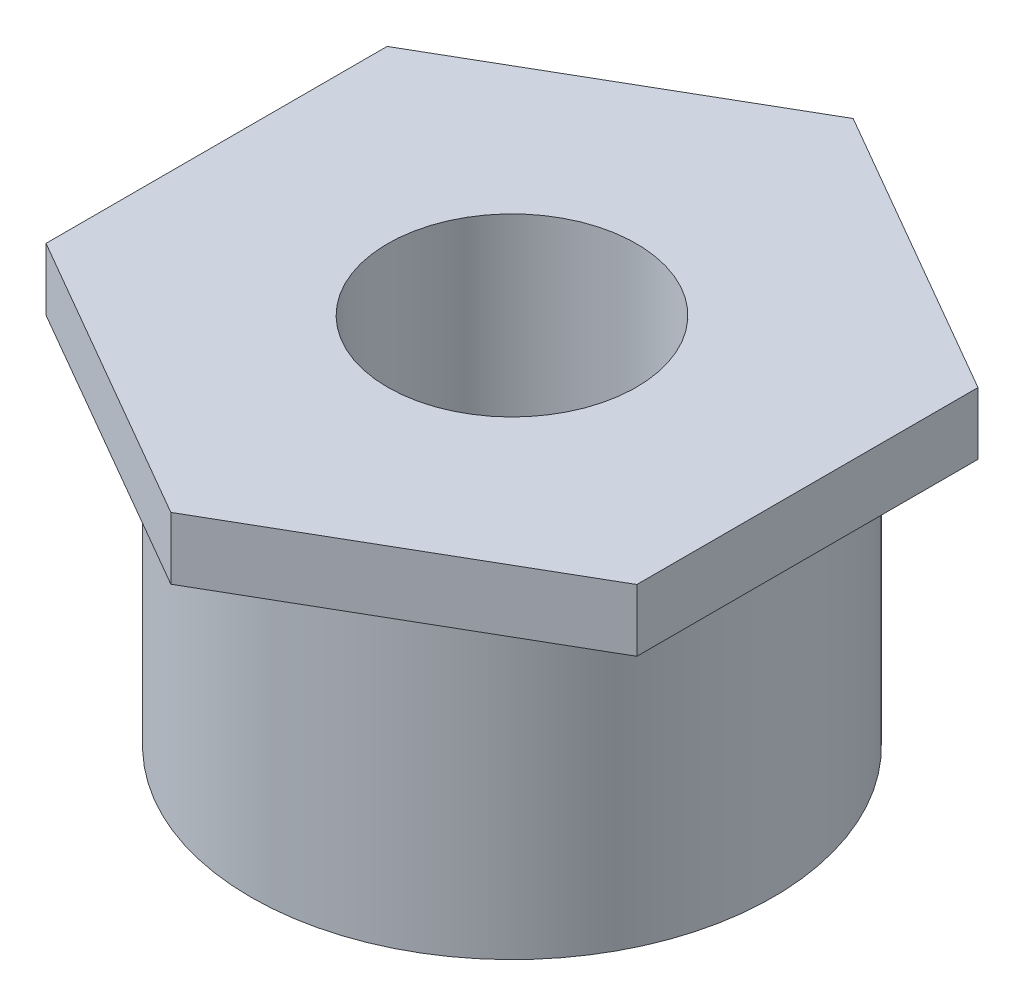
ISO-10303-21;
HEADER;
FILE_DESCRIPTION(('STEP AP214'),'2;1');
FILE_NAME('part.step','',(''),(''),'','','');
FILE_SCHEMA(('AUTOMOTIVE_DESIGN { 1 0 10303 214 1 1 1 1 }'));
ENDSEC;
DATA;
#1=APPLICATION_CONTEXT('core data for automotive mechanical design processes');
#2=APPLICATION_PROTOCOL_DEFINITION('international standard','automotive_design',2000,#1);
#3=PRODUCT_CONTEXT('',#1,'mechanical');
#4=PRODUCT('Part','Part','',(#3));
#5=PRODUCT_RELATED_PRODUCT_CATEGORY('part','',(#4));
#6=PRODUCT_DEFINITION_FORMATION('','',#4);
#7=PRODUCT_DEFINITION_CONTEXT('part definition',#1,'design');
#8=PRODUCT_DEFINITION('design','',#6,#7);
#9=PRODUCT_DEFINITION_SHAPE('','',#8);
#10=(LENGTH_UNIT() NAMED_UNIT(*) SI_UNIT(.MILLI.,.METRE.));
#11=(NAMED_UNIT(*) PLANE_ANGLE_UNIT() SI_UNIT($,.RADIAN.));
#12=(NAMED_UNIT(*) SI_UNIT($,.STERADIAN.) SOLID_ANGLE_UNIT());
#13=UNCERTAINTY_MEASURE_WITH_UNIT(LENGTH_MEASURE(1.E-05),#10,'distance_accuracy_value','');
#14=(GEOMETRIC_REPRESENTATION_CONTEXT(3) GLOBAL_UNCERTAINTY_ASSIGNED_CONTEXT((#13)) GLOBAL_UNIT_ASSIGNED_CONTEXT((#10,
#11,#12)) REPRESENTATION_CONTEXT('',''));
#15=CARTESIAN_POINT('',(0.,0.,0.));
#16=DIRECTION('',(0.,0.,1.));
#17=DIRECTION('',(1.,0.,0.));
#18=AXIS2_PLACEMENT_3D('',#15,#16,#17);
#19=CARTESIAN_POINT('',(0.,-3.,0.));
#20=DIRECTION('',(0.,1.,0.));
#21=DIRECTION('',(0.,0.,1.));
#22=AXIS2_PLACEMENT_3D('',#19,#20,#21);
#23=CYLINDRICAL_SURFACE('',#22,2.1);
#24=CARTESIAN_POINT('',(0.,-3.,0.));
#25=DIRECTION('',(0.,1.,0.));
#26=DIRECTION('',(0.,0.,1.));
#27=AXIS2_PLACEMENT_3D('',#24,#25,#26);
#28=CIRCLE('',#27,2.1);
#29=CARTESIAN_POINT('',(0.,-3.,2.1));
#30=VERTEX_POINT('',#29);
#31=EDGE_CURVE('E11',#30,#30,#28,.T.);
#32=ORIENTED_EDGE('',*,*,#31,.T.);
#33=EDGE_LOOP('',(#32));
#34=FACE_BOUND('',#33,.T.);
#35=CARTESIAN_POINT('',(0.,-0.5,0.));
#36=DIRECTION('',(0.,1.,0.));
#37=DIRECTION('',(0.,0.,1.));
#38=AXIS2_PLACEMENT_3D('',#35,#36,#37);
#39=CIRCLE('',#38,2.1);
#40=CARTESIAN_POINT('',(0.,-0.5,2.1));
#41=VERTEX_POINT('',#40);
#42=EDGE_CURVE('E147',#41,#41,#39,.T.);
#43=ORIENTED_EDGE('',*,*,#42,.F.);
#44=EDGE_LOOP('',(#43));
#45=FACE_BOUND('',#44,.T.);
#46=ADVANCED_FACE('F43',(#34,#45),#23,.T.);
#47=CARTESIAN_POINT('',(0.,-3.,0.));
#48=DIRECTION('',(0.,1.,0.));
#49=DIRECTION('',(0.,0.,1.));
#50=AXIS2_PLACEMENT_3D('',#47,#48,#49);
#51=CYLINDRICAL_SURFACE('',#50,1.);
#52=CARTESIAN_POINT('',(0.,-3.,0.));
#53=DIRECTION('',(0.,1.,0.));
#54=DIRECTION('',(0.,0.,1.));
#55=AXIS2_PLACEMENT_3D('',#52,#53,#54);
#56=CIRCLE('',#55,1.);
#57=CARTESIAN_POINT('',(0.,-3.,1.));
#58=VERTEX_POINT('',#57);
#59=EDGE_CURVE('E53',#58,#58,#56,.T.);
#60=ORIENTED_EDGE('',*,*,#59,.F.);
#61=EDGE_LOOP('',(#60));
#62=FACE_BOUND('',#61,.T.);
#63=CARTESIAN_POINT('',(0.,0.,0.));
#64=DIRECTION('',(0.,1.,0.));
#65=DIRECTION('',(0.,0.,1.));
#66=AXIS2_PLACEMENT_3D('',#63,#64,#65);
#67=CIRCLE('',#66,1.);
#68=CARTESIAN_POINT('',(0.,0.,1.));
#69=VERTEX_POINT('',#68);
#70=EDGE_CURVE('E47',#69,#69,#67,.T.);
#71=ORIENTED_EDGE('',*,*,#70,.T.);
#72=EDGE_LOOP('',(#71));
#73=FACE_BOUND('',#72,.T.);
#74=ADVANCED_FACE('F45',(#62,#73),#51,.F.);
#75=CARTESIAN_POINT('',(0.,-3.,0.));
#76=DIRECTION('',(0.,1.,0.));
#77=DIRECTION('',(0.,0.,1.));
#78=AXIS2_PLACEMENT_3D('',#75,#76,#77);
#79=PLANE('',#78);
#80=ORIENTED_EDGE('',*,*,#59,.T.);
#81=EDGE_LOOP('',(#80));
#82=FACE_BOUND('',#81,.T.);
#83=ORIENTED_EDGE('',*,*,#31,.F.);
#84=EDGE_LOOP('',(#83));
#85=FACE_BOUND('',#84,.T.);
#86=ADVANCED_FACE('F165',(#82,#85),#79,.F.);
#87=CARTESIAN_POINT('',(0.,0.,0.));
#88=DIRECTION('',(0.,1.,0.));
#89=DIRECTION('',(0.,0.,1.));
#90=AXIS2_PLACEMENT_3D('',#87,#88,#89);
#91=PLANE('',#90);
#92=ORIENTED_EDGE('',*,*,#70,.F.);
#93=EDGE_LOOP('',(#92));
#94=FACE_BOUND('',#93,.T.);
#95=DIRECTION('',(0.,0.,-1.));
#96=VECTOR('',#95,1.);
#97=CARTESIAN_POINT('',(2.375,0.,0.));
#98=LINE('',#97,#96);
#99=CARTESIAN_POINT('',(2.375,0.,1.37120688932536));
#100=VERTEX_POINT('',#99);
#101=CARTESIAN_POINT('',(2.375,0.,-1.37120688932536));
#102=VERTEX_POINT('',#101);
#103=EDGE_CURVE('E132',#100,#102,#98,.T.);
#104=ORIENTED_EDGE('',*,*,#103,.T.);
#105=DIRECTION('',(-0.866025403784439,0.,-0.5));
#106=VECTOR('',#105,1.);
#107=CARTESIAN_POINT('',(1.1875,0.,-2.05681033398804));
#108=LINE('',#107,#106);
#109=CARTESIAN_POINT('',(0.,0.,-2.74241377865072));
#110=VERTEX_POINT('',#109);
#111=EDGE_CURVE('E135',#102,#110,#108,.T.);
#112=ORIENTED_EDGE('',*,*,#111,.T.);
#113=DIRECTION('',(-0.866025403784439,0.,0.5));
#114=VECTOR('',#113,1.);
#115=CARTESIAN_POINT('',(-1.1875,0.,-2.05681033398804));
#116=LINE('',#115,#114);
#117=CARTESIAN_POINT('',(-2.375,0.,-1.37120688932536));
#118=VERTEX_POINT('',#117);
#119=EDGE_CURVE('E138',#110,#118,#116,.T.);
#120=ORIENTED_EDGE('',*,*,#119,.T.);
#121=DIRECTION('',(0.,0.,1.));
#122=VECTOR('',#121,1.);
#123=CARTESIAN_POINT('',(-2.375,0.,0.));
#124=LINE('',#123,#122);
#125=CARTESIAN_POINT('',(-2.375,0.,1.37120688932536));
#126=VERTEX_POINT('',#125);
#127=EDGE_CURVE('E141',#118,#126,#124,.T.);
#128=ORIENTED_EDGE('',*,*,#127,.T.);
#129=DIRECTION('',(0.866025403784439,0.,0.5));
#130=VECTOR('',#129,1.);
#131=CARTESIAN_POINT('',(-1.1875,0.,2.05681033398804));
#132=LINE('',#131,#130);
#133=CARTESIAN_POINT('',(0.,0.,2.74241377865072));
#134=VERTEX_POINT('',#133);
#135=EDGE_CURVE('E109',#126,#134,#132,.T.);
#136=ORIENTED_EDGE('',*,*,#135,.T.);
#137=DIRECTION('',(0.866025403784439,0.,-0.5));
#138=VECTOR('',#137,1.);
#139=CARTESIAN_POINT('',(1.1875,0.,2.05681033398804));
#140=LINE('',#139,#138);
#141=EDGE_CURVE('E144',#134,#100,#140,.T.);
#142=ORIENTED_EDGE('',*,*,#141,.T.);
#143=EDGE_LOOP('',(#104,#112,#120,#128,#136,#142));
#144=FACE_BOUND('',#143,.T.);
#145=ADVANCED_FACE('F161',(#94,#144),#91,.T.);
#146=CARTESIAN_POINT('',(2.375,-0.5,0.));
#147=DIRECTION('',(1.,0.,0.));
#148=DIRECTION('',(0.,0.,-1.));
#149=AXIS2_PLACEMENT_3D('',#146,#147,#148);
#150=PLANE('',#149);
#151=ORIENTED_EDGE('',*,*,#103,.F.);
#152=DIRECTION('',(0.,1.,0.));
#153=VECTOR('',#152,1.);
#154=CARTESIAN_POINT('',(2.375,-0.5,1.37120688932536));
#155=LINE('',#154,#153);
#156=CARTESIAN_POINT('',(2.375,-0.5,1.37120688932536));
#157=VERTEX_POINT('',#156);
#158=EDGE_CURVE('E61',#157,#100,#155,.T.);
#159=ORIENTED_EDGE('',*,*,#158,.F.);
#160=DIRECTION('',(0.,0.,-1.));
#161=VECTOR('',#160,1.);
#162=CARTESIAN_POINT('',(2.375,-0.5,0.));
#163=LINE('',#162,#161);
#164=CARTESIAN_POINT('',(2.375,-0.5,-1.37120688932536));
#165=VERTEX_POINT('',#164);
#166=EDGE_CURVE('E167',#157,#165,#163,.T.);
#167=ORIENTED_EDGE('',*,*,#166,.T.);
#168=DIRECTION('',(0.,1.,0.));
#169=VECTOR('',#168,1.);
#170=CARTESIAN_POINT('',(2.375,-0.5,-1.37120688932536));
#171=LINE('',#170,#169);
#172=EDGE_CURVE('E96',#165,#102,#171,.T.);
#173=ORIENTED_EDGE('',*,*,#172,.T.);
#174=EDGE_LOOP('',(#151,#159,#167,#173));
#175=FACE_BOUND('',#174,.T.);
#176=ADVANCED_FACE('F164',(#175),#150,.T.);
#177=CARTESIAN_POINT('',(1.1875,-0.5,2.05681033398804));
#178=DIRECTION('',(0.5,0.,0.866025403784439));
#179=DIRECTION('',(0.866025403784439,0.,-0.5));
#180=AXIS2_PLACEMENT_3D('',#177,#178,#179);
#181=PLANE('',#180);
#182=ORIENTED_EDGE('',*,*,#141,.F.);
#183=DIRECTION('',(0.,1.,0.));
#184=VECTOR('',#183,1.);
#185=CARTESIAN_POINT('',(0.,-0.5,2.74241377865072));
#186=LINE('',#185,#184);
#187=CARTESIAN_POINT('',(0.,-0.5,2.74241377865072));
#188=VERTEX_POINT('',#187);
#189=EDGE_CURVE('E84',#188,#134,#186,.T.);
#190=ORIENTED_EDGE('',*,*,#189,.F.);
#191=DIRECTION('',(0.866025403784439,0.,-0.5));
#192=VECTOR('',#191,1.);
#193=CARTESIAN_POINT('',(1.1875,-0.5,2.05681033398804));
#194=LINE('',#193,#192);
#195=EDGE_CURVE('E122',#188,#157,#194,.T.);
#196=ORIENTED_EDGE('',*,*,#195,.T.);
#197=ORIENTED_EDGE('',*,*,#158,.T.);
#198=EDGE_LOOP('',(#182,#190,#196,#197));
#199=FACE_BOUND('',#198,.T.);
#200=ADVANCED_FACE('F172',(#199),#181,.T.);
#201=CARTESIAN_POINT('',(-1.1875,-0.5,2.05681033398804));
#202=DIRECTION('',(-0.5,0.,0.866025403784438));
#203=DIRECTION('',(0.866025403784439,0.,0.5));
#204=AXIS2_PLACEMENT_3D('',#201,#202,#203);
#205=PLANE('',#204);
#206=ORIENTED_EDGE('',*,*,#135,.F.);
#207=DIRECTION('',(0.,1.,0.));
#208=VECTOR('',#207,1.);
#209=CARTESIAN_POINT('',(-2.375,-0.5,1.37120688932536));
#210=LINE('',#209,#208);
#211=CARTESIAN_POINT('',(-2.375,-0.5,1.37120688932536));
#212=VERTEX_POINT('',#211);
#213=EDGE_CURVE('E104',#212,#126,#210,.T.);
#214=ORIENTED_EDGE('',*,*,#213,.F.);
#215=DIRECTION('',(0.866025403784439,0.,0.5));
#216=VECTOR('',#215,1.);
#217=CARTESIAN_POINT('',(-1.1875,-0.5,2.05681033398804));
#218=LINE('',#217,#216);
#219=EDGE_CURVE('E107',#212,#188,#218,.T.);
#220=ORIENTED_EDGE('',*,*,#219,.T.);
#221=ORIENTED_EDGE('',*,*,#189,.T.);
#222=EDGE_LOOP('',(#206,#214,#220,#221));
#223=FACE_BOUND('',#222,.T.);
#224=ADVANCED_FACE('F106',(#223),#205,.T.);
#225=CARTESIAN_POINT('',(-2.375,-0.5,0.));
#226=DIRECTION('',(-1.,0.,0.));
#227=DIRECTION('',(0.,0.,1.));
#228=AXIS2_PLACEMENT_3D('',#225,#226,#227);
#229=PLANE('',#228);
#230=ORIENTED_EDGE('',*,*,#127,.F.);
#231=DIRECTION('',(0.,1.,0.));
#232=VECTOR('',#231,1.);
#233=CARTESIAN_POINT('',(-2.375,-0.5,-1.37120688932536));
#234=LINE('',#233,#232);
#235=CARTESIAN_POINT('',(-2.375,-0.5,-1.37120688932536));
#236=VERTEX_POINT('',#235);
#237=EDGE_CURVE('E114',#236,#118,#234,.T.);
#238=ORIENTED_EDGE('',*,*,#237,.F.);
#239=DIRECTION('',(0.,0.,1.));
#240=VECTOR('',#239,1.);
#241=CARTESIAN_POINT('',(-2.375,-0.5,0.));
#242=LINE('',#241,#240);
#243=EDGE_CURVE('E120',#236,#212,#242,.T.);
#244=ORIENTED_EDGE('',*,*,#243,.T.);
#245=ORIENTED_EDGE('',*,*,#213,.T.);
#246=EDGE_LOOP('',(#230,#238,#244,#245));
#247=FACE_BOUND('',#246,.T.);
#248=ADVANCED_FACE('F124',(#247),#229,.T.);
#249=CARTESIAN_POINT('',(-1.1875,-0.5,-2.05681033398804));
#250=DIRECTION('',(-0.5,0.,-0.866025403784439));
#251=DIRECTION('',(-0.866025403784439,0.,0.5));
#252=AXIS2_PLACEMENT_3D('',#249,#250,#251);
#253=PLANE('',#252);
#254=ORIENTED_EDGE('',*,*,#119,.F.);
#255=DIRECTION('',(0.,1.,0.));
#256=VECTOR('',#255,1.);
#257=CARTESIAN_POINT('',(0.,-0.5,-2.74241377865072));
#258=LINE('',#257,#256);
#259=CARTESIAN_POINT('',(0.,-0.5,-2.74241377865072));
#260=VERTEX_POINT('',#259);
#261=EDGE_CURVE('E151',#260,#110,#258,.T.);
#262=ORIENTED_EDGE('',*,*,#261,.F.);
#263=DIRECTION('',(-0.866025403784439,0.,0.5));
#264=VECTOR('',#263,1.);
#265=CARTESIAN_POINT('',(-1.1875,-0.5,-2.05681033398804));
#266=LINE('',#265,#264);
#267=EDGE_CURVE('E125',#260,#236,#266,.T.);
#268=ORIENTED_EDGE('',*,*,#267,.T.);
#269=ORIENTED_EDGE('',*,*,#237,.T.);
#270=EDGE_LOOP('',(#254,#262,#268,#269));
#271=FACE_BOUND('',#270,.T.);
#272=ADVANCED_FACE('F171',(#271),#253,.T.);
#273=CARTESIAN_POINT('',(1.1875,-0.5,-2.05681033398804));
#274=DIRECTION('',(0.5,0.,-0.866025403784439));
#275=DIRECTION('',(-0.866025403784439,0.,-0.5));
#276=AXIS2_PLACEMENT_3D('',#273,#274,#275);
#277=PLANE('',#276);
#278=ORIENTED_EDGE('',*,*,#111,.F.);
#279=ORIENTED_EDGE('',*,*,#172,.F.);
#280=DIRECTION('',(-0.866025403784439,0.,-0.5));
#281=VECTOR('',#280,1.);
#282=CARTESIAN_POINT('',(1.1875,-0.5,-2.05681033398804));
#283=LINE('',#282,#281);
#284=EDGE_CURVE('E127',#165,#260,#283,.T.);
#285=ORIENTED_EDGE('',*,*,#284,.T.);
#286=ORIENTED_EDGE('',*,*,#261,.T.);
#287=EDGE_LOOP('',(#278,#279,#285,#286));
#288=FACE_BOUND('',#287,.T.);
#289=ADVANCED_FACE('F168',(#288),#277,.T.);
#290=CARTESIAN_POINT('',(0.,-0.5,0.));
#291=DIRECTION('',(0.,1.,0.));
#292=DIRECTION('',(0.,0.,1.));
#293=AXIS2_PLACEMENT_3D('',#290,#291,#292);
#294=PLANE('',#293);
#295=ORIENTED_EDGE('',*,*,#42,.T.);
#296=EDGE_LOOP('',(#295));
#297=FACE_BOUND('',#296,.T.);
#298=ORIENTED_EDGE('',*,*,#166,.F.);
#299=ORIENTED_EDGE('',*,*,#195,.F.);
#300=ORIENTED_EDGE('',*,*,#219,.F.);
#301=ORIENTED_EDGE('',*,*,#243,.F.);
#302=ORIENTED_EDGE('',*,*,#267,.F.);
#303=ORIENTED_EDGE('',*,*,#284,.F.);
#304=EDGE_LOOP('',(#298,#299,#300,#301,#302,#303));
#305=FACE_BOUND('',#304,.T.);
#306=ADVANCED_FACE('F118',(#297,#305),#294,.F.);
#307=CLOSED_SHELL('',(#46,#74,#86,#145,#176,#200,#224,#248,#272,#289,#306));
#308=MANIFOLD_SOLID_BREP('B2',#307);
#309=ADVANCED_BREP_SHAPE_REPRESENTATION('',(#18,#308),#14);
#310=SHAPE_DEFINITION_REPRESENTATION(#9,#309);
ENDSEC;
END-ISO-10303-21;
